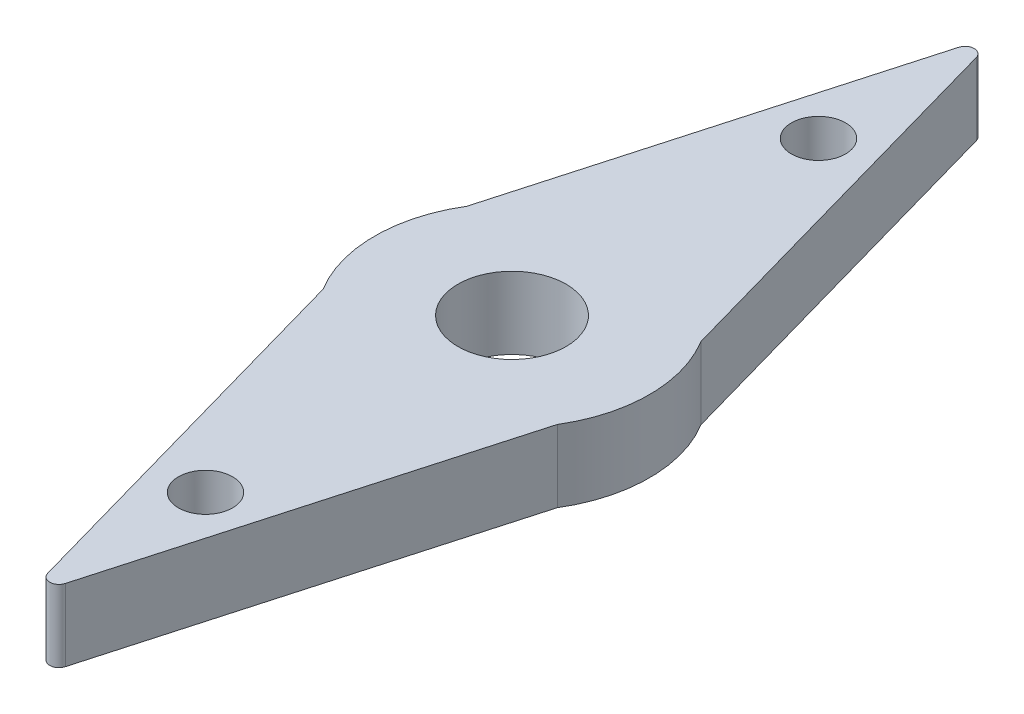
from build123d import *

# Parameters (mm, degrees)
SKETCH1_R           = 3.81
BOSS_EXTRUDE1_DEPTH = 2
BOSS_EXTRUDE2_START = -2
BOSS_EXTRUDE2_DEPTH = 2
FILLET1_R           = 0.254
SKETCH3_R           = 0.75
CUT_EXTRUDE1_DEPTH  = 2
SKETCH4_R           = 1.5
CUT_EXTRUDE2_DEPTH  = 14.521792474


with BuildPart() as part:
    # Sketch1 → Boss-Extrude1 (new body)
    with BuildSketch(Plane(origin=(0, 0, 0), x_dir=(1, 0, 0), z_dir=(0, 1, 0))):
        with Locations(Location((0, 0, 0), (0, 0, 270))):
            Circle(SKETCH1_R)
    extrude(amount=BOSS_EXTRUDE1_DEPTH)

    # Sketch2 → Boss-Extrude2 (add)
    with BuildSketch(Plane(origin=(0, 2, 0), x_dir=(1, 0, 0), z_dir=(0, 1, 0)).offset(BOSS_EXTRUDE2_START)):
        with BuildLine():
            Line((0, -13.5), (3.247846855, -1.991881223))
            ThreePointArc((3.247846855, -1.991881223), (0, -3.81), (-3.247846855, -1.991881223))
            Line((-3.247846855, -1.991881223), (0, -13.5))
        make_face()
        with BuildLine():
            ThreePointArc((-3.247846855, 1.991881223), (0, 3.81), (3.247846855, 1.991881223))
            Line((3.247846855, 1.991881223), (0, 13.5))
            Line((0, 13.5), (-3.247846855, 1.991881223))
        make_face()
    extrude(amount=BOSS_EXTRUDE2_DEPTH)

    # Fillet1
    fillet1_edges = [part.edges().sort_by_distance(p)[0] for p in [
        (0, 1, -13.5),
        (0, 1, 13.5),
    ]]
    fillet(fillet1_edges, radius=FILLET1_R)

    # Sketch3 → Cut-Extrude1 (cut)
    with BuildSketch(Plane(origin=(0, 2, 0), x_dir=(1, 0, 0), z_dir=(0, 1, 0))):
        with Locations(Location((0, 8.5, 0), (0, 0, 270))):
            Circle(SKETCH3_R)
        with Locations(Location((0, -8.5, 0), (0, 0, 270))):
            Circle(SKETCH3_R)
    extrude(amount=-CUT_EXTRUDE1_DEPTH, mode=Mode.SUBTRACT)

    # Sketch4 → Cut-Extrude2 (cut, through all)
    with BuildSketch(Plane.XZ):
        with Locations(Location((0, 0, 0), (0, 0, 270))):
            Circle(SKETCH4_R)
    extrude(amount=-CUT_EXTRUDE2_DEPTH, mode=Mode.SUBTRACT)


solid = part.part
